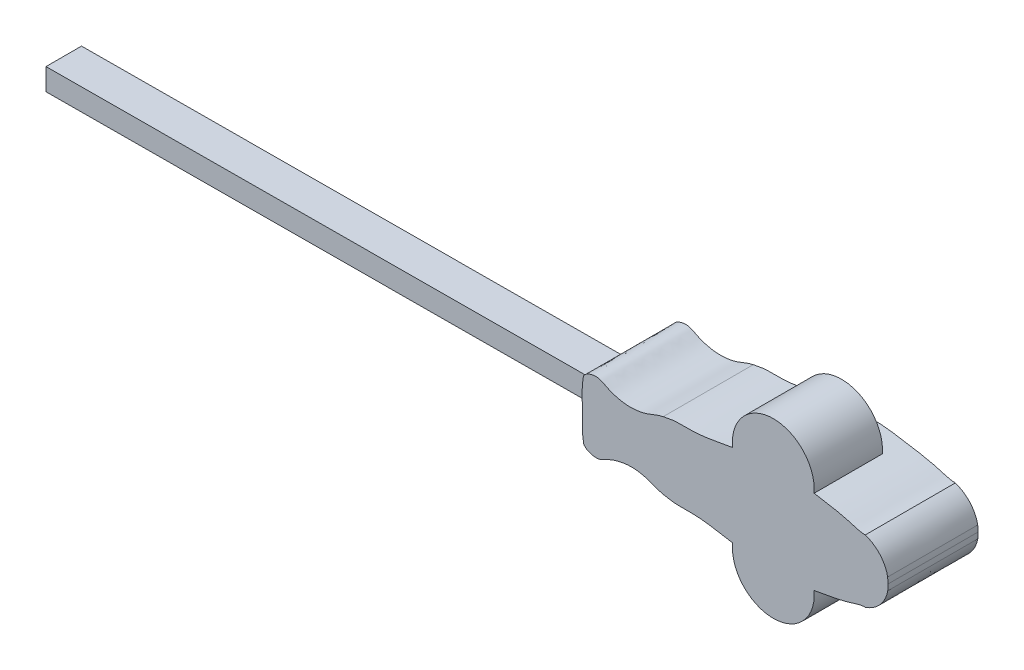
ISO-10303-21;
HEADER;
FILE_DESCRIPTION(('STEP AP214'),'2;1');
FILE_NAME('part.step','',(''),(''),'','','');
FILE_SCHEMA(('AUTOMOTIVE_DESIGN { 1 0 10303 214 1 1 1 1 }'));
ENDSEC;
DATA;
#1=APPLICATION_CONTEXT('core data for automotive mechanical design processes');
#2=APPLICATION_PROTOCOL_DEFINITION('international standard','automotive_design',2000,#1);
#3=PRODUCT_CONTEXT('',#1,'mechanical');
#4=PRODUCT('Part','Part','',(#3));
#5=PRODUCT_RELATED_PRODUCT_CATEGORY('part','',(#4));
#6=PRODUCT_DEFINITION_FORMATION('','',#4);
#7=PRODUCT_DEFINITION_CONTEXT('part definition',#1,'design');
#8=PRODUCT_DEFINITION('design','',#6,#7);
#9=PRODUCT_DEFINITION_SHAPE('','',#8);
#10=(LENGTH_UNIT() NAMED_UNIT(*) SI_UNIT(.MILLI.,.METRE.));
#11=(NAMED_UNIT(*) PLANE_ANGLE_UNIT() SI_UNIT($,.RADIAN.));
#12=(NAMED_UNIT(*) SI_UNIT($,.STERADIAN.) SOLID_ANGLE_UNIT());
#13=UNCERTAINTY_MEASURE_WITH_UNIT(LENGTH_MEASURE(1.E-05),#10,'distance_accuracy_value','');
#14=(GEOMETRIC_REPRESENTATION_CONTEXT(3) GLOBAL_UNCERTAINTY_ASSIGNED_CONTEXT((#13)) GLOBAL_UNIT_ASSIGNED_CONTEXT((#10,
#11,#12)) REPRESENTATION_CONTEXT('',''));
#15=CARTESIAN_POINT('',(0.,0.,0.));
#16=DIRECTION('',(0.,0.,1.));
#17=DIRECTION('',(1.,0.,0.));
#18=AXIS2_PLACEMENT_3D('',#15,#16,#17);
#19=CARTESIAN_POINT('',(0.,0.,-16.5));
#20=DIRECTION('',(-1.,0.,0.));
#21=DIRECTION('',(0.,0.,1.));
#22=AXIS2_PLACEMENT_3D('',#19,#20,#21);
#23=PLANE('',#22);
#24=DIRECTION('',(0.,-1.,0.));
#25=VECTOR('',#24,1.);
#26=CARTESIAN_POINT('',(0.,0.,-4.));
#27=LINE('',#26,#25);
#28=CARTESIAN_POINT('',(0.,0.,-4.));
#29=VERTEX_POINT('',#28);
#30=CARTESIAN_POINT('',(0.,-3.40142625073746,-4.));
#31=VERTEX_POINT('',#30);
#32=EDGE_CURVE('E674',#29,#31,#27,.T.);
#33=ORIENTED_EDGE('',*,*,#32,.F.);
#34=DIRECTION('',(0.,0.,1.));
#35=VECTOR('',#34,1.);
#36=CARTESIAN_POINT('',(0.,0.,-16.5));
#37=LINE('',#36,#35);
#38=CARTESIAN_POINT('',(0.,0.,-16.5));
#39=VERTEX_POINT('',#38);
#40=EDGE_CURVE('E295',#39,#29,#37,.T.);
#41=ORIENTED_EDGE('',*,*,#40,.F.);
#42=DIRECTION('',(0.,-1.,0.));
#43=VECTOR('',#42,1.);
#44=CARTESIAN_POINT('',(0.,0.,-16.5));
#45=LINE('',#44,#43);
#46=CARTESIAN_POINT('',(0.,-3.40142625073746,-16.5));
#47=VERTEX_POINT('',#46);
#48=EDGE_CURVE('E611',#39,#47,#45,.T.);
#49=ORIENTED_EDGE('',*,*,#48,.T.);
#50=DIRECTION('',(0.,0.,1.));
#51=VECTOR('',#50,1.);
#52=CARTESIAN_POINT('',(0.,-3.40142625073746,-16.5));
#53=LINE('',#52,#51);
#54=EDGE_CURVE('E294',#47,#31,#53,.T.);
#55=ORIENTED_EDGE('',*,*,#54,.T.);
#56=EDGE_LOOP('',(#33,#41,#49,#55));
#57=FACE_BOUND('',#56,.T.);
#58=ADVANCED_FACE('F41',(#57),#23,.T.);
#59=CARTESIAN_POINT('',(0.,0.,-16.5));
#60=DIRECTION('',(0.999953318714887,0.00966231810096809,0.));
#61=DIRECTION('',(-0.00966231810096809,0.999953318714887,0.));
#62=AXIS2_PLACEMENT_3D('',#59,#60,#61);
#63=PLANE('',#62);
#64=ORIENTED_EDGE('',*,*,#40,.T.);
#65=DIRECTION('',(-0.00966231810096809,0.999953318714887,0.));
#66=VECTOR('',#65,1.);
#67=CARTESIAN_POINT('',(0.,0.,-4.));
#68=LINE('',#67,#66);
#69=CARTESIAN_POINT('',(-0.0328656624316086,3.40126746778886,-4.));
#70=VERTEX_POINT('',#69);
#71=EDGE_CURVE('E314',#29,#70,#68,.T.);
#72=ORIENTED_EDGE('',*,*,#71,.T.);
#73=DIRECTION('',(0.,0.,1.));
#74=VECTOR('',#73,1.);
#75=CARTESIAN_POINT('',(-0.0328656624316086,3.40126746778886,-16.5));
#76=LINE('',#75,#74);
#77=CARTESIAN_POINT('',(-0.0328656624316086,3.40126746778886,-16.5));
#78=VERTEX_POINT('',#77);
#79=EDGE_CURVE('E306',#78,#70,#76,.T.);
#80=ORIENTED_EDGE('',*,*,#79,.F.);
#81=DIRECTION('',(-0.00966231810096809,0.999953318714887,0.));
#82=VECTOR('',#81,1.);
#83=CARTESIAN_POINT('',(0.,0.,-16.5));
#84=LINE('',#83,#82);
#85=EDGE_CURVE('E614',#39,#78,#84,.T.);
#86=ORIENTED_EDGE('',*,*,#85,.F.);
#87=EDGE_LOOP('',(#64,#72,#80,#86));
#88=FACE_BOUND('',#87,.T.);
#89=ADVANCED_FACE('F251',(#88),#63,.F.);
#90=CARTESIAN_POINT('',(-0.0328656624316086,3.40126746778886,-16.5));
#91=CARTESIAN_POINT('',(-0.224843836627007,7.16255319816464,-16.5));
#92=CARTESIAN_POINT('',(0.440236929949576,10.8822575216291,-16.5));
#93=B_SPLINE_CURVE_WITH_KNOTS('',2,(#90,#91,#92),.UNSPECIFIED.,.F.,.F.,(3,3),(0.,1.),.UNSPECIFIED.);
#94=DIRECTION('',(0.,0.,1.));
#95=VECTOR('',#94,1.);
#96=SURFACE_OF_LINEAR_EXTRUSION('',#93,#95);
#97=ORIENTED_EDGE('',*,*,#79,.T.);
#98=CARTESIAN_POINT('',(-0.0328656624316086,3.40126746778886,-4.));
#99=CARTESIAN_POINT('',(-0.224843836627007,7.16255319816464,-4.));
#100=CARTESIAN_POINT('',(0.440236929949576,10.8822575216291,-4.));
#101=B_SPLINE_CURVE_WITH_KNOTS('',2,(#98,#99,#100),.UNSPECIFIED.,.F.,.F.,(3,3),(0.,1.),.UNSPECIFIED.);
#102=CARTESIAN_POINT('',(-0.0579969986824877,3.99976648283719,-4.));
#103=VERTEX_POINT('',#102);
#104=EDGE_CURVE('E643',#70,#103,#101,.T.);
#105=ORIENTED_EDGE('',*,*,#104,.T.);
#106=DIRECTION('',(0.,0.,1.));
#107=VECTOR('',#106,1.);
#108=CARTESIAN_POINT('',(-0.0579969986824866,3.99976648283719,-16.5));
#109=LINE('',#108,#107);
#110=CARTESIAN_POINT('',(-0.0579969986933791,3.99976648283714,9.01614070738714));
#111=VERTEX_POINT('',#110);
#112=EDGE_CURVE('E11',#103,#111,#109,.T.);
#113=ORIENTED_EDGE('',*,*,#112,.T.);
#114=CARTESIAN_POINT('',(-0.0328656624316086,3.40126746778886,9.01614070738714));
#115=CARTESIAN_POINT('',(-0.224843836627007,7.16255319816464,9.01614070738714));
#116=CARTESIAN_POINT('',(0.440236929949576,10.8822575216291,9.01614070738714));
#117=B_SPLINE_CURVE_WITH_KNOTS('',2,(#114,#115,#116),.UNSPECIFIED.,.F.,.F.,(3,3),(0.,1.),.UNSPECIFIED.);
#118=CARTESIAN_POINT('',(-0.0328656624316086,3.40126746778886,9.01614070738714));
#119=VERTEX_POINT('',#118);
#120=EDGE_CURVE('E680',#111,#119,#117,.F.);
#121=ORIENTED_EDGE('',*,*,#120,.T.);
#122=CARTESIAN_POINT('',(-0.0328656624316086,3.40126746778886,16.5));
#123=VERTEX_POINT('',#122);
#124=EDGE_CURVE('E310',#119,#123,#76,.T.);
#125=ORIENTED_EDGE('',*,*,#124,.T.);
#126=CARTESIAN_POINT('',(-0.0328656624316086,3.40126746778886,16.5));
#127=CARTESIAN_POINT('',(-0.224843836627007,7.16255319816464,16.5));
#128=CARTESIAN_POINT('',(0.440236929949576,10.8822575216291,16.5));
#129=B_SPLINE_CURVE_WITH_KNOTS('',2,(#126,#127,#128),.UNSPECIFIED.,.F.,.F.,(3,3),(0.,1.),.UNSPECIFIED.);
#130=CARTESIAN_POINT('',(0.440236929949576,10.8822575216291,16.5));
#131=VERTEX_POINT('',#130);
#132=EDGE_CURVE('E638',#123,#131,#129,.T.);
#133=ORIENTED_EDGE('',*,*,#132,.T.);
#134=DIRECTION('',(0.,0.,1.));
#135=VECTOR('',#134,1.);
#136=CARTESIAN_POINT('',(0.440236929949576,10.8822575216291,-16.5));
#137=LINE('',#136,#135);
#138=CARTESIAN_POINT('',(0.440236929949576,10.8822575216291,-16.5));
#139=VERTEX_POINT('',#138);
#140=EDGE_CURVE('E315',#139,#131,#137,.T.);
#141=ORIENTED_EDGE('',*,*,#140,.F.);
#142=EDGE_CURVE('E624',#78,#139,#93,.T.);
#143=ORIENTED_EDGE('',*,*,#142,.F.);
#144=EDGE_LOOP('',(#97,#105,#113,#121,#125,#133,#141,#143));
#145=FACE_BOUND('',#144,.T.);
#146=ADVANCED_FACE('F43',(#145),#96,.F.);
#147=CARTESIAN_POINT('',(0.440236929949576,10.8822575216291,-16.5));
#148=CARTESIAN_POINT('',(1.2545844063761,11.9870686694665,-16.5));
#149=CARTESIAN_POINT('',(3.1984745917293,12.8617459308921,-16.5));
#150=CARTESIAN_POINT('',(6.06946087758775,12.9836702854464,-16.5));
#151=CARTESIAN_POINT('',(8.10206341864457,11.9647141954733,-16.5));
#152=CARTESIAN_POINT('',(10.410042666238,10.7755542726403,-16.5));
#153=CARTESIAN_POINT('',(13.1861198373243,9.93656936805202,-16.5));
#154=CARTESIAN_POINT('',(16.5420551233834,9.38374930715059,-16.5));
#155=CARTESIAN_POINT('',(20.1718624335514,9.5213119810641,-16.5));
#156=CARTESIAN_POINT('',(24.0575079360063,10.3963118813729,-16.5));
#157=CARTESIAN_POINT('',(27.0776430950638,11.8209129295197,-16.5));
#158=CARTESIAN_POINT('',(29.0453889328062,12.3411585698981,-16.5));
#159=CARTESIAN_POINT('',(29.6585793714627,12.4932887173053,-16.5));
#160=B_SPLINE_CURVE_WITH_KNOTS('',3,(#147,#148,#149,#150,#151,#152,#153,#154,#155,#156,#157,
#158,#159),.UNSPECIFIED.,.F.,.F.,(4,1,1,1,1,1,1,1,1,1,4),(0.,0.120356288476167,
0.182103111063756,0.252493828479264,0.320379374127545,0.416926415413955,0.511670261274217,
0.625759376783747,0.741661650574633,0.867963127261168,0.924773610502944),.UNSPECIFIED.);
#161=DIRECTION('',(0.,0.,1.));
#162=VECTOR('',#161,1.);
#163=SURFACE_OF_LINEAR_EXTRUSION('',#160,#162);
#164=ORIENTED_EDGE('',*,*,#140,.T.);
#165=CARTESIAN_POINT('',(0.440236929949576,10.8822575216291,16.5));
#166=CARTESIAN_POINT('',(1.2545844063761,11.9870686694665,16.5));
#167=CARTESIAN_POINT('',(3.1984745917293,12.8617459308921,16.5));
#168=CARTESIAN_POINT('',(6.06946087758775,12.9836702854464,16.5));
#169=CARTESIAN_POINT('',(8.10206341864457,11.9647141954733,16.5));
#170=CARTESIAN_POINT('',(10.410042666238,10.7755542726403,16.5));
#171=CARTESIAN_POINT('',(13.1861198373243,9.93656936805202,16.5));
#172=CARTESIAN_POINT('',(16.5420551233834,9.38374930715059,16.5));
#173=CARTESIAN_POINT('',(20.1718624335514,9.5213119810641,16.5));
#174=CARTESIAN_POINT('',(24.0575079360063,10.3963118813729,16.5));
#175=CARTESIAN_POINT('',(27.0776430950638,11.8209129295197,16.5));
#176=CARTESIAN_POINT('',(29.0453889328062,12.3411585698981,16.5));
#177=CARTESIAN_POINT('',(29.6585793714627,12.4932887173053,16.5));
#178=B_SPLINE_CURVE_WITH_KNOTS('',3,(#165,#166,#167,#168,#169,#170,#171,#172,#173,#174,#175,
#176,#177),.UNSPECIFIED.,.F.,.F.,(4,1,1,1,1,1,1,1,1,1,4),(0.,0.120356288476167,
0.182103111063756,0.252493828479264,0.320379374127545,0.416926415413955,0.511670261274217,
0.625759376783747,0.741661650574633,0.867963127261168,0.924773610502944),.UNSPECIFIED.);
#179=CARTESIAN_POINT('',(29.6585793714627,12.4932887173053,16.5));
#180=VERTEX_POINT('',#179);
#181=EDGE_CURVE('E378',#131,#180,#178,.T.);
#182=ORIENTED_EDGE('',*,*,#181,.T.);
#183=DIRECTION('',(0.,0.,1.));
#184=VECTOR('',#183,1.);
#185=CARTESIAN_POINT('',(29.6585793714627,12.4932887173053,-16.5));
#186=LINE('',#185,#184);
#187=CARTESIAN_POINT('',(29.6585793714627,12.4932887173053,-16.5));
#188=VERTEX_POINT('',#187);
#189=EDGE_CURVE('E454',#188,#180,#186,.T.);
#190=ORIENTED_EDGE('',*,*,#189,.F.);
#191=EDGE_CURVE('E438',#139,#188,#160,.T.);
#192=ORIENTED_EDGE('',*,*,#191,.F.);
#193=EDGE_LOOP('',(#164,#182,#190,#192));
#194=FACE_BOUND('',#193,.T.);
#195=ADVANCED_FACE('F430',(#194),#163,.F.);
#196=CARTESIAN_POINT('',(29.6585793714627,12.4932887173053,-16.5));
#197=CARTESIAN_POINT('',(31.0128652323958,12.7506046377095,-16.5));
#198=CARTESIAN_POINT('',(33.0414585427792,13.2110228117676,-16.5));
#199=CARTESIAN_POINT('',(36.2612563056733,13.2560790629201,-16.5));
#200=CARTESIAN_POINT('',(39.0452583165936,13.2577644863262,-16.5));
#201=CARTESIAN_POINT('',(42.4985052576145,13.3903631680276,-16.5));
#202=CARTESIAN_POINT('',(46.0869267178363,13.7929133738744,-16.5));
#203=CARTESIAN_POINT('',(49.779062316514,14.4884361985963,-16.5));
#204=CARTESIAN_POINT('',(53.4778441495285,15.157919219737,-16.5));
#205=CARTESIAN_POINT('',(57.1168962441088,15.7270449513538,-16.5));
#206=CARTESIAN_POINT('',(60.9657898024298,16.2710657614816,-16.5));
#207=CARTESIAN_POINT('',(64.9828941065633,16.6262630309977,-16.5));
#208=CARTESIAN_POINT('',(69.1101359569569,17.0899493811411,-16.5));
#209=CARTESIAN_POINT('',(73.4451248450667,17.0625696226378,-16.5));
#210=CARTESIAN_POINT('',(77.6235824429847,16.9670082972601,-16.5));
#211=CARTESIAN_POINT('',(81.8363104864,16.3230746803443,-16.5));
#212=CARTESIAN_POINT('',(86.1669893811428,15.6372598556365,-16.5));
#213=CARTESIAN_POINT('',(91.7093018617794,14.7383170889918,-16.5));
#214=CARTESIAN_POINT('',(97.6251708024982,13.4829344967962,-16.5));
#215=CARTESIAN_POINT('',(101.818778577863,11.9447202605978,-16.5));
#216=CARTESIAN_POINT('',(103.707407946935,11.9908059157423,-16.5));
#217=B_SPLINE_CURVE_WITH_KNOTS('',3,(#196,#197,#198,#199,#200,#201,#202,#203,#204,#205,#206,
#207,#208,#209,#210,#211,#212,#213,#214,#215,#216),.UNSPECIFIED.,.F.,.F.,(4,1,1,1,1,1,1,1,1,1,1,
1,1,1,1,1,1,1,4),(0.,0.0553981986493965,0.0826774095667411,0.128818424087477,0.167035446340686,
0.221096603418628,0.273333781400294,0.317568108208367,0.371733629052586,0.420941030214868,
0.473294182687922,0.533363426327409,0.587167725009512,0.646878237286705,0.700631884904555,
0.757710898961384,0.822668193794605,0.92558882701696,1.),.UNSPECIFIED.);
#218=DIRECTION('',(0.,0.,1.));
#219=VECTOR('',#218,1.);
#220=SURFACE_OF_LINEAR_EXTRUSION('',#217,#219);
#221=CARTESIAN_POINT('',(29.6585793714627,12.4932887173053,16.5));
#222=CARTESIAN_POINT('',(31.0128652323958,12.7506046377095,16.5));
#223=CARTESIAN_POINT('',(33.0414585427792,13.2110228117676,16.5));
#224=CARTESIAN_POINT('',(36.2612563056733,13.2560790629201,16.5));
#225=CARTESIAN_POINT('',(39.0452583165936,13.2577644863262,16.5));
#226=CARTESIAN_POINT('',(42.4985052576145,13.3903631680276,16.5));
#227=CARTESIAN_POINT('',(46.0869267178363,13.7929133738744,16.5));
#228=CARTESIAN_POINT('',(49.779062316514,14.4884361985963,16.5));
#229=CARTESIAN_POINT('',(53.4778441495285,15.157919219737,16.5));
#230=CARTESIAN_POINT('',(57.1168962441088,15.7270449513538,16.5));
#231=CARTESIAN_POINT('',(60.9657898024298,16.2710657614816,16.5));
#232=CARTESIAN_POINT('',(64.9828941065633,16.6262630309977,16.5));
#233=CARTESIAN_POINT('',(69.1101359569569,17.0899493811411,16.5));
#234=CARTESIAN_POINT('',(73.4451248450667,17.0625696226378,16.5));
#235=CARTESIAN_POINT('',(77.6235824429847,16.9670082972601,16.5));
#236=CARTESIAN_POINT('',(81.8363104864,16.3230746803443,16.5));
#237=CARTESIAN_POINT('',(86.1669893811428,15.6372598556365,16.5));
#238=CARTESIAN_POINT('',(91.7093018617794,14.7383170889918,16.5));
#239=CARTESIAN_POINT('',(97.6251708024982,13.4829344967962,16.5));
#240=CARTESIAN_POINT('',(101.818778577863,11.9447202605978,16.5));
#241=CARTESIAN_POINT('',(103.707407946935,11.9908059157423,16.5));
#242=B_SPLINE_CURVE_WITH_KNOTS('',3,(#221,#222,#223,#224,#225,#226,#227,#228,#229,#230,#231,
#232,#233,#234,#235,#236,#237,#238,#239,#240,#241),.UNSPECIFIED.,.F.,.F.,(4,1,1,1,1,1,1,1,1,1,1,
1,1,1,1,1,1,1,4),(0.,0.0553981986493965,0.0826774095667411,0.128818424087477,0.167035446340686,
0.221096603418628,0.273333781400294,0.317568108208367,0.371733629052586,0.420941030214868,
0.473294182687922,0.533363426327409,0.587167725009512,0.646878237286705,0.700631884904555,
0.757710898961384,0.822668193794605,0.92558882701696,1.),.UNSPECIFIED.);
#243=CARTESIAN_POINT('',(55.0895967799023,15.4061525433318,16.5));
#244=VERTEX_POINT('',#243);
#245=EDGE_CURVE('E214',#180,#244,#242,.T.);
#246=ORIENTED_EDGE('',*,*,#245,.T.);
#247=DIRECTION('',(0.,0.,1.));
#248=VECTOR('',#247,1.);
#249=CARTESIAN_POINT('',(55.0895967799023,15.4061525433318,-8.5));
#250=LINE('',#249,#248);
#251=CARTESIAN_POINT('',(55.0895967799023,15.4061525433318,-8.5));
#252=VERTEX_POINT('',#251);
#253=EDGE_CURVE('E62',#252,#244,#250,.T.);
#254=ORIENTED_EDGE('',*,*,#253,.F.);
#255=CARTESIAN_POINT('',(55.0895967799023,15.4061525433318,-8.5));
#256=CARTESIAN_POINT('',(55.8060649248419,15.5197730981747,-8.5));
#257=CARTESIAN_POINT('',(57.7371095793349,15.8147088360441,-8.5));
#258=CARTESIAN_POINT('',(60.9657898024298,16.2710657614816,-8.5));
#259=CARTESIAN_POINT('',(64.9828941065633,16.6262630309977,-8.5));
#260=CARTESIAN_POINT('',(69.1101359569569,17.0899493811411,-8.5));
#261=CARTESIAN_POINT('',(73.4451248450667,17.0625696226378,-8.5));
#262=CARTESIAN_POINT('',(77.6235824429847,16.9670082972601,-8.5));
#263=CARTESIAN_POINT('',(81.4946798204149,16.3752943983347,-8.5));
#264=CARTESIAN_POINT('',(83.8851899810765,15.9983753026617,-8.5));
#265=CARTESIAN_POINT('',(84.9507542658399,15.8287112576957,-8.5));
#266=B_SPLINE_CURVE_WITH_KNOTS('',3,(#255,#256,#257,#258,#259,#260,#261,#262,#263,#264,#265),
.UNSPECIFIED.,.F.,.F.,(4,1,1,1,1,1,1,1,4),(0.342661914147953,0.371733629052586,
0.420941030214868,0.473294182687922,0.533363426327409,0.587167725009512,0.646878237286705,
0.700631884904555,0.743880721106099),.UNSPECIFIED.);
#267=CARTESIAN_POINT('',(84.9507542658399,15.8287112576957,-8.5));
#268=VERTEX_POINT('',#267);
#269=EDGE_CURVE('E66',#252,#268,#266,.T.);
#270=ORIENTED_EDGE('',*,*,#269,.T.);
#271=DIRECTION('',(0.,0.,1.));
#272=VECTOR('',#271,1.);
#273=CARTESIAN_POINT('',(84.9507542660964,15.828711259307,-8.5));
#274=LINE('',#273,#272);
#275=CARTESIAN_POINT('',(84.9507542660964,15.828711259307,16.5));
#276=VERTEX_POINT('',#275);
#277=EDGE_CURVE('E216',#268,#276,#274,.T.);
#278=ORIENTED_EDGE('',*,*,#277,.T.);
#279=CARTESIAN_POINT('',(103.707407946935,11.9908059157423,16.5));
#280=VERTEX_POINT('',#279);
#281=EDGE_CURVE('E202',#276,#280,#242,.T.);
#282=ORIENTED_EDGE('',*,*,#281,.T.);
#283=DIRECTION('',(0.,0.,1.));
#284=VECTOR('',#283,1.);
#285=CARTESIAN_POINT('',(103.707407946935,11.9908059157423,-16.5));
#286=LINE('',#285,#284);
#287=CARTESIAN_POINT('',(103.707407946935,11.9908059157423,-16.5));
#288=VERTEX_POINT('',#287);
#289=EDGE_CURVE('E457',#288,#280,#286,.T.);
#290=ORIENTED_EDGE('',*,*,#289,.F.);
#291=EDGE_CURVE('E444',#188,#288,#217,.T.);
#292=ORIENTED_EDGE('',*,*,#291,.F.);
#293=ORIENTED_EDGE('',*,*,#189,.T.);
#294=EDGE_LOOP('',(#246,#254,#270,#278,#282,#290,#292,#293));
#295=FACE_BOUND('',#294,.T.);
#296=ADVANCED_FACE('F217',(#295),#220,.F.);
#297=CARTESIAN_POINT('',(103.707407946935,11.9908059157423,-16.5));
#298=CARTESIAN_POINT('',(105.28126794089,11.4133673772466,-16.5));
#299=CARTESIAN_POINT('',(109.12557010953,9.28181191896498,-16.5));
#300=CARTESIAN_POINT('',(111.416904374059,5.30759409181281,-16.5));
#301=CARTESIAN_POINT('',(111.90109030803,2.73355710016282,-16.5));
#302=B_SPLINE_CURVE_WITH_KNOTS('',3,(#297,#298,#299,#300,#301),.UNSPECIFIED.,.F.,.F.,(4,1,4),
(0.,0.39082533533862,1.),.UNSPECIFIED.);
#303=DIRECTION('',(0.,0.,1.));
#304=VECTOR('',#303,1.);
#305=SURFACE_OF_LINEAR_EXTRUSION('',#302,#304);
#306=ORIENTED_EDGE('',*,*,#289,.T.);
#307=CARTESIAN_POINT('',(103.707407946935,11.9908059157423,16.5));
#308=CARTESIAN_POINT('',(105.28126794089,11.4133673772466,16.5));
#309=CARTESIAN_POINT('',(109.12557010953,9.28181191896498,16.5));
#310=CARTESIAN_POINT('',(111.416904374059,5.30759409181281,16.5));
#311=CARTESIAN_POINT('',(111.90109030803,2.73355710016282,16.5));
#312=B_SPLINE_CURVE_WITH_KNOTS('',3,(#307,#308,#309,#310,#311),.UNSPECIFIED.,.F.,.F.,(4,1,4),
(0.,0.39082533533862,1.),.UNSPECIFIED.);
#313=CARTESIAN_POINT('',(111.90109030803,2.73355710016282,16.5));
#314=VERTEX_POINT('',#313);
#315=EDGE_CURVE('E210',#280,#314,#312,.T.);
#316=ORIENTED_EDGE('',*,*,#315,.T.);
#317=DIRECTION('',(0.,0.,1.));
#318=VECTOR('',#317,1.);
#319=CARTESIAN_POINT('',(111.90109030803,2.73355710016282,-16.5));
#320=LINE('',#319,#318);
#321=CARTESIAN_POINT('',(111.90109030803,2.73355710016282,-16.5));
#322=VERTEX_POINT('',#321);
#323=EDGE_CURVE('E460',#322,#314,#320,.T.);
#324=ORIENTED_EDGE('',*,*,#323,.F.);
#325=EDGE_CURVE('E518',#288,#322,#302,.T.);
#326=ORIENTED_EDGE('',*,*,#325,.F.);
#327=EDGE_LOOP('',(#306,#316,#324,#326));
#328=FACE_BOUND('',#327,.T.);
#329=ADVANCED_FACE('F515',(#328),#305,.F.);
#330=CARTESIAN_POINT('',(112.,0.541102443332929,-16.5));
#331=CARTESIAN_POINT('',(111.994702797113,1.63754310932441,-16.5));
#332=CARTESIAN_POINT('',(111.90109030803,2.73355710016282,-16.5));
#333=B_SPLINE_CURVE_WITH_KNOTS('',2,(#330,#331,#332),.UNSPECIFIED.,.F.,.F.,(3,3),(0.5,1.),.UNSPECIFIED.);
#334=DIRECTION('',(0.,0.,1.));
#335=VECTOR('',#334,1.);
#336=SURFACE_OF_LINEAR_EXTRUSION('',#333,#335);
#337=ORIENTED_EDGE('',*,*,#323,.T.);
#338=CARTESIAN_POINT('',(112.,0.541102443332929,16.5));
#339=CARTESIAN_POINT('',(111.994702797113,1.63754310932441,16.5));
#340=CARTESIAN_POINT('',(111.90109030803,2.73355710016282,16.5));
#341=B_SPLINE_CURVE_WITH_KNOTS('',2,(#338,#339,#340),.UNSPECIFIED.,.F.,.F.,(3,3),(0.5,1.),.UNSPECIFIED.);
#342=CARTESIAN_POINT('',(112.,0.54110244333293,16.5));
#343=VERTEX_POINT('',#342);
#344=EDGE_CURVE('E356',#343,#314,#341,.T.);
#345=ORIENTED_EDGE('',*,*,#344,.F.);
#346=DIRECTION('',(0.,0.,1.));
#347=VECTOR('',#346,1.);
#348=CARTESIAN_POINT('',(112.,0.54110244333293,-16.5));
#349=LINE('',#348,#347);
#350=CARTESIAN_POINT('',(112.,0.54110244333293,-16.5));
#351=VERTEX_POINT('',#350);
#352=EDGE_CURVE('E463',#351,#343,#349,.T.);
#353=ORIENTED_EDGE('',*,*,#352,.F.);
#354=EDGE_CURVE('E523',#351,#322,#333,.T.);
#355=ORIENTED_EDGE('',*,*,#354,.T.);
#356=EDGE_LOOP('',(#337,#345,#353,#355));
#357=FACE_BOUND('',#356,.T.);
#358=ADVANCED_FACE('F538',(#357),#336,.T.);
#359=CARTESIAN_POINT('',(112.,0.541102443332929,-16.5));
#360=CARTESIAN_POINT('',(112.005297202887,-0.555338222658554,-16.5));
#361=CARTESIAN_POINT('',(111.922279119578,-1.65220556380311,-16.5));
#362=B_SPLINE_CURVE_WITH_KNOTS('',2,(#359,#360,#361),.UNSPECIFIED.,.F.,.F.,(3,3),(0.5,1.),.UNSPECIFIED.);
#363=DIRECTION('',(0.,0.,1.));
#364=VECTOR('',#363,1.);
#365=SURFACE_OF_LINEAR_EXTRUSION('',#362,#364);
#366=ORIENTED_EDGE('',*,*,#352,.T.);
#367=CARTESIAN_POINT('',(112.,0.541102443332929,16.5));
#368=CARTESIAN_POINT('',(112.005297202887,-0.555338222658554,16.5));
#369=CARTESIAN_POINT('',(111.922279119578,-1.65220556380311,16.5));
#370=B_SPLINE_CURVE_WITH_KNOTS('',2,(#367,#368,#369),.UNSPECIFIED.,.F.,.F.,(3,3),(0.5,1.),.UNSPECIFIED.);
#371=CARTESIAN_POINT('',(111.922279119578,-1.65220556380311,16.5));
#372=VERTEX_POINT('',#371);
#373=EDGE_CURVE('E347',#343,#372,#370,.T.);
#374=ORIENTED_EDGE('',*,*,#373,.T.);
#375=DIRECTION('',(0.,0.,1.));
#376=VECTOR('',#375,1.);
#377=CARTESIAN_POINT('',(111.922279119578,-1.65220556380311,-16.5));
#378=LINE('',#377,#376);
#379=CARTESIAN_POINT('',(111.922279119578,-1.65220556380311,-16.5));
#380=VERTEX_POINT('',#379);
#381=EDGE_CURVE('E466',#380,#372,#378,.T.);
#382=ORIENTED_EDGE('',*,*,#381,.F.);
#383=EDGE_CURVE('E509',#351,#380,#362,.T.);
#384=ORIENTED_EDGE('',*,*,#383,.F.);
#385=EDGE_LOOP('',(#366,#374,#382,#384));
#386=FACE_BOUND('',#385,.T.);
#387=ADVANCED_FACE('F508',(#386),#365,.F.);
#388=CARTESIAN_POINT('',(103.818425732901,-10.9881922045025,-16.5));
#389=CARTESIAN_POINT('',(105.386632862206,-10.3955734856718,-16.5));
#390=CARTESIAN_POINT('',(109.210159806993,-8.22697266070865,-16.5));
#391=CARTESIAN_POINT('',(111.462986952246,-4.23080075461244,-16.5));
#392=CARTESIAN_POINT('',(111.922279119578,-1.65220556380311,-16.5));
#393=B_SPLINE_CURVE_WITH_KNOTS('',3,(#388,#389,#390,#391,#392),.UNSPECIFIED.,.F.,.F.,(4,1,4),
(0.,0.39082533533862,1.),.UNSPECIFIED.);
#394=DIRECTION('',(0.,0.,1.));
#395=VECTOR('',#394,1.);
#396=SURFACE_OF_LINEAR_EXTRUSION('',#393,#395);
#397=ORIENTED_EDGE('',*,*,#381,.T.);
#398=CARTESIAN_POINT('',(103.818425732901,-10.9881922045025,16.5));
#399=CARTESIAN_POINT('',(105.386632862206,-10.3955734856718,16.5));
#400=CARTESIAN_POINT('',(109.210159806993,-8.22697266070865,16.5));
#401=CARTESIAN_POINT('',(111.462986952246,-4.23080075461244,16.5));
#402=CARTESIAN_POINT('',(111.922279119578,-1.65220556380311,16.5));
#403=B_SPLINE_CURVE_WITH_KNOTS('',3,(#398,#399,#400,#401,#402),.UNSPECIFIED.,.F.,.F.,(4,1,4),
(0.,0.39082533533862,1.),.UNSPECIFIED.);
#404=CARTESIAN_POINT('',(103.818425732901,-10.9881922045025,16.5));
#405=VERTEX_POINT('',#404);
#406=EDGE_CURVE('E326',#405,#372,#403,.T.);
#407=ORIENTED_EDGE('',*,*,#406,.F.);
#408=DIRECTION('',(0.,0.,1.));
#409=VECTOR('',#408,1.);
#410=CARTESIAN_POINT('',(103.818425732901,-10.9881922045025,-16.5));
#411=LINE('',#410,#409);
#412=CARTESIAN_POINT('',(103.818425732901,-10.9881922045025,-16.5));
#413=VERTEX_POINT('',#412);
#414=EDGE_CURVE('E469',#413,#405,#411,.T.);
#415=ORIENTED_EDGE('',*,*,#414,.F.);
#416=EDGE_CURVE('E505',#413,#380,#393,.T.);
#417=ORIENTED_EDGE('',*,*,#416,.T.);
#418=EDGE_LOOP('',(#397,#407,#415,#417));
#419=FACE_BOUND('',#418,.T.);
#420=ADVANCED_FACE('F503',(#419),#396,.T.);
#421=CARTESIAN_POINT('',(29.7779090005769,-12.2061348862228,-16.5));
#422=CARTESIAN_POINT('',(31.134617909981,-12.4503532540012,-16.5));
#423=CARTESIAN_POINT('',(33.1675652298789,-12.8911490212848,-16.5));
#424=CARTESIAN_POINT('',(36.3876480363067,-12.9050924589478,-16.5));
#425=CARTESIAN_POINT('',(39.1715363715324,-12.8798778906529,-16.5));
#426=CARTESIAN_POINT('',(42.6259033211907,-12.9791040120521,-16.5));
#427=CARTESIAN_POINT('',(46.2180468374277,-13.3469629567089,-16.5));
#428=CARTESIAN_POINT('',(49.9167304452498,-14.0067787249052,-16.5));
#429=CARTESIAN_POINT('',(53.6218083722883,-14.6404916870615,-16.5));
#430=CARTESIAN_POINT('',(57.2661896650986,-15.1744291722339,-16.5));
#431=CARTESIAN_POINT('',(61.1201600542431,-15.6812353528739,-16.5));
#432=CARTESIAN_POINT('',(65.1405088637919,-15.9976015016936,-16.5));
#433=CARTESIAN_POINT('',(69.2720383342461,-16.4213874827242,-16.5));
#434=CARTESIAN_POINT('',(73.6065603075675,-16.3521229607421,-16.5));
#435=CARTESIAN_POINT('',(77.7838995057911,-16.2161925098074,-16.5));
#436=CARTESIAN_POINT('',(81.9902090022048,-15.5315842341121,-16.5));
#437=CARTESIAN_POINT('',(86.3140591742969,-14.8039570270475,-16.5));
#438=CARTESIAN_POINT('',(91.8474270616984,-13.8515046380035,-16.5));
#439=CARTESIAN_POINT('',(97.7508899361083,-12.5390196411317,-16.5));
#440=CARTESIAN_POINT('',(101.929439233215,-10.9603572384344,-16.5));
#441=CARTESIAN_POINT('',(103.818425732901,-10.9881922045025,-16.5));
#442=B_SPLINE_CURVE_WITH_KNOTS('',3,(#421,#422,#423,#424,#425,#426,#427,#428,#429,#430,#431,
#432,#433,#434,#435,#436,#437,#438,#439,#440,#441),.UNSPECIFIED.,.F.,.F.,(4,1,1,1,1,1,1,1,1,1,1,
1,1,1,1,1,1,1,4),(0.,0.0553981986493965,0.0826774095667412,0.128818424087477,0.167035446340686,
0.221096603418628,0.273333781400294,0.317568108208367,0.371733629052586,0.420941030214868,
0.473294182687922,0.533363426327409,0.587167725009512,0.646878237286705,0.700631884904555,
0.757710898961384,0.822668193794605,0.92558882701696,1.),.UNSPECIFIED.);
#443=DIRECTION('',(0.,0.,1.));
#444=VECTOR('',#443,1.);
#445=SURFACE_OF_LINEAR_EXTRUSION('',#442,#444);
#446=DIRECTION('',(0.,0.,1.));
#447=VECTOR('',#446,1.);
#448=CARTESIAN_POINT('',(55.0764935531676,-14.8493703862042,-8.5));
#449=LINE('',#448,#447);
#450=CARTESIAN_POINT('',(55.0764935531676,-14.8493703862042,-8.5));
#451=VERTEX_POINT('',#450);
#452=CARTESIAN_POINT('',(55.0764935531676,-14.8493703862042,16.5));
#453=VERTEX_POINT('',#452);
#454=EDGE_CURVE('E595',#451,#453,#449,.T.);
#455=ORIENTED_EDGE('',*,*,#454,.T.);
#456=CARTESIAN_POINT('',(29.7779090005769,-12.2061348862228,16.5));
#457=CARTESIAN_POINT('',(31.134617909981,-12.4503532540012,16.5));
#458=CARTESIAN_POINT('',(33.1675652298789,-12.8911490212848,16.5));
#459=CARTESIAN_POINT('',(36.3876480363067,-12.9050924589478,16.5));
#460=CARTESIAN_POINT('',(39.1715363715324,-12.8798778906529,16.5));
#461=CARTESIAN_POINT('',(42.6259033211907,-12.9791040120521,16.5));
#462=CARTESIAN_POINT('',(46.2180468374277,-13.3469629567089,16.5));
#463=CARTESIAN_POINT('',(49.9167304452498,-14.0067787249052,16.5));
#464=CARTESIAN_POINT('',(53.6218083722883,-14.6404916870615,16.5));
#465=CARTESIAN_POINT('',(57.2661896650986,-15.1744291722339,16.5));
#466=CARTESIAN_POINT('',(61.1201600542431,-15.6812353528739,16.5));
#467=CARTESIAN_POINT('',(65.1405088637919,-15.9976015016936,16.5));
#468=CARTESIAN_POINT('',(69.2720383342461,-16.4213874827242,16.5));
#469=CARTESIAN_POINT('',(73.6065603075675,-16.3521229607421,16.5));
#470=CARTESIAN_POINT('',(77.7838995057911,-16.2161925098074,16.5));
#471=CARTESIAN_POINT('',(81.9902090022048,-15.5315842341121,16.5));
#472=CARTESIAN_POINT('',(86.3140591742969,-14.8039570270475,16.5));
#473=CARTESIAN_POINT('',(91.8474270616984,-13.8515046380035,16.5));
#474=CARTESIAN_POINT('',(97.7508899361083,-12.5390196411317,16.5));
#475=CARTESIAN_POINT('',(101.929439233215,-10.9603572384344,16.5));
#476=CARTESIAN_POINT('',(103.818425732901,-10.9881922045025,16.5));
#477=B_SPLINE_CURVE_WITH_KNOTS('',3,(#456,#457,#458,#459,#460,#461,#462,#463,#464,#465,#466,
#467,#468,#469,#470,#471,#472,#473,#474,#475,#476),.UNSPECIFIED.,.F.,.F.,(4,1,1,1,1,1,1,1,1,1,1,
1,1,1,1,1,1,1,4),(0.,0.0553981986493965,0.0826774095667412,0.128818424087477,0.167035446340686,
0.221096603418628,0.273333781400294,0.317568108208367,0.371733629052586,0.420941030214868,
0.473294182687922,0.533363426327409,0.587167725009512,0.646878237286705,0.700631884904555,
0.757710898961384,0.822668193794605,0.92558882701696,1.),.UNSPECIFIED.);
#478=CARTESIAN_POINT('',(29.7779090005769,-12.2061348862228,16.5));
#479=VERTEX_POINT('',#478);
#480=EDGE_CURVE('E321',#479,#453,#477,.T.);
#481=ORIENTED_EDGE('',*,*,#480,.F.);
#482=DIRECTION('',(0.,0.,1.));
#483=VECTOR('',#482,1.);
#484=CARTESIAN_POINT('',(29.7779090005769,-12.2061348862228,-16.5));
#485=LINE('',#484,#483);
#486=CARTESIAN_POINT('',(29.7779090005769,-12.2061348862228,-16.5));
#487=VERTEX_POINT('',#486);
#488=EDGE_CURVE('E472',#487,#479,#485,.T.);
#489=ORIENTED_EDGE('',*,*,#488,.F.);
#490=EDGE_CURVE('E499',#487,#413,#442,.T.);
#491=ORIENTED_EDGE('',*,*,#490,.T.);
#492=ORIENTED_EDGE('',*,*,#414,.T.);
#493=CARTESIAN_POINT('',(84.9410694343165,-15.0339759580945,16.5));
#494=VERTEX_POINT('',#493);
#495=EDGE_CURVE('E327',#494,#405,#477,.T.);
#496=ORIENTED_EDGE('',*,*,#495,.F.);
#497=DIRECTION('',(0.,0.,1.));
#498=VECTOR('',#497,1.);
#499=CARTESIAN_POINT('',(84.9410694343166,-15.0339759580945,-8.5));
#500=LINE('',#499,#498);
#501=CARTESIAN_POINT('',(84.9410694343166,-15.0339759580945,-8.5));
#502=VERTEX_POINT('',#501);
#503=EDGE_CURVE('E591',#502,#494,#500,.T.);
#504=ORIENTED_EDGE('',*,*,#503,.F.);
#505=CARTESIAN_POINT('',(84.9410694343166,-15.0339759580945,-8.5));
#506=CARTESIAN_POINT('',(83.9300533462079,-15.2048289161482,-8.5));
#507=CARTESIAN_POINT('',(81.5960721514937,-15.5957329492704,-8.5));
#508=CARTESIAN_POINT('',(77.7838995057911,-16.2161925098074,-8.5));
#509=CARTESIAN_POINT('',(73.6065603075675,-16.3521229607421,-8.5));
#510=CARTESIAN_POINT('',(69.2720383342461,-16.4213874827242,-8.5));
#511=CARTESIAN_POINT('',(65.1405088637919,-15.9976015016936,-8.5));
#512=CARTESIAN_POINT('',(61.1201600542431,-15.6812353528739,-8.5));
#513=CARTESIAN_POINT('',(57.8339431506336,-15.2490900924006,-8.5));
#514=CARTESIAN_POINT('',(55.8470548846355,-14.9646211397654,-8.5));
#515=CARTESIAN_POINT('',(55.0764935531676,-14.8493703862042,-8.5));
#516=B_SPLINE_CURVE_WITH_KNOTS('',3,(#505,#506,#507,#508,#509,#510,#511,#512,#513,#514,#515),
.UNSPECIFIED.,.F.,.F.,(4,1,1,1,1,1,1,1,4),(0.340509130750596,0.38160802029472,0.43536166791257,
0.495072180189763,0.548876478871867,0.608945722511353,0.661298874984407,0.710506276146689,
0.741730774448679),.UNSPECIFIED.);
#517=EDGE_CURVE('E588',#502,#451,#516,.T.);
#518=ORIENTED_EDGE('',*,*,#517,.T.);
#519=EDGE_LOOP('',(#455,#481,#489,#491,#492,#496,#504,#518));
#520=FACE_BOUND('',#519,.T.);
#521=ADVANCED_FACE('F497',(#520),#445,.T.);
#522=CARTESIAN_POINT('',(0.545364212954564,-10.8774958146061,-16.5));
#523=CARTESIAN_POINT('',(1.37034871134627,-11.9743869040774,-16.5));
#524=CARTESIAN_POINT('',(3.32259956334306,-12.8302408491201,-16.5));
#525=CARTESIAN_POINT('',(6.19462989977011,-12.9244191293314,-16.5));
#526=CARTESIAN_POINT('',(8.21729207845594,-11.8858709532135,-16.5));
#527=CARTESIAN_POINT('',(10.5136735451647,-10.6744661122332,-16.5));
#528=CARTESIAN_POINT('',(13.281514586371,-9.80869703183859,-16.5));
#529=CARTESIAN_POINT('',(16.6319516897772,-9.22347666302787,-16.5));
#530=CARTESIAN_POINT('',(20.2629187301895,-9.32596056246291,-16.5));
#531=CARTESIAN_POINT('',(24.1568373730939,-10.1633752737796,-16.5));
#532=CARTESIAN_POINT('',(27.1905964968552,-11.558728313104,-16.5));
#533=CARTESIAN_POINT('',(29.1632772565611,-12.0599366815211,-16.5));
#534=CARTESIAN_POINT('',(29.7779090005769,-12.2061348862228,-16.5));
#535=B_SPLINE_CURVE_WITH_KNOTS('',3,(#522,#523,#524,#525,#526,#527,#528,#529,#530,#531,#532,
#533,#534),.UNSPECIFIED.,.F.,.F.,(4,1,1,1,1,1,1,1,1,1,4),(0.,0.120356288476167,
0.182103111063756,0.252493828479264,0.320379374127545,0.416926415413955,0.511670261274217,
0.625759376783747,0.741661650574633,0.867963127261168,0.924773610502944),.UNSPECIFIED.);
#536=DIRECTION('',(0.,0.,1.));
#537=VECTOR('',#536,1.);
#538=SURFACE_OF_LINEAR_EXTRUSION('',#535,#537);
#539=ORIENTED_EDGE('',*,*,#488,.T.);
#540=CARTESIAN_POINT('',(0.545364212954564,-10.8774958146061,16.5));
#541=CARTESIAN_POINT('',(1.37034871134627,-11.9743869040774,16.5));
#542=CARTESIAN_POINT('',(3.32259956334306,-12.8302408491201,16.5));
#543=CARTESIAN_POINT('',(6.19462989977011,-12.9244191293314,16.5));
#544=CARTESIAN_POINT('',(8.21729207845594,-11.8858709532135,16.5));
#545=CARTESIAN_POINT('',(10.5136735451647,-10.6744661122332,16.5));
#546=CARTESIAN_POINT('',(13.281514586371,-9.80869703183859,16.5));
#547=CARTESIAN_POINT('',(16.6319516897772,-9.22347666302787,16.5));
#548=CARTESIAN_POINT('',(20.2629187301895,-9.32596056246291,16.5));
#549=CARTESIAN_POINT('',(24.1568373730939,-10.1633752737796,16.5));
#550=CARTESIAN_POINT('',(27.1905964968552,-11.558728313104,16.5));
#551=CARTESIAN_POINT('',(29.1632772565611,-12.0599366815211,16.5));
#552=CARTESIAN_POINT('',(29.7779090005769,-12.2061348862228,16.5));
#553=B_SPLINE_CURVE_WITH_KNOTS('',3,(#540,#541,#542,#543,#544,#545,#546,#547,#548,#549,#550,
#551,#552),.UNSPECIFIED.,.F.,.F.,(4,1,1,1,1,1,1,1,1,1,4),(0.,0.120356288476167,
0.182103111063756,0.252493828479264,0.320379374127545,0.416926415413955,0.511670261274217,
0.625759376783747,0.741661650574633,0.867963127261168,0.924773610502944),.UNSPECIFIED.);
#554=CARTESIAN_POINT('',(0.545364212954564,-10.8774958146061,16.5));
#555=VERTEX_POINT('',#554);
#556=EDGE_CURVE('E334',#555,#479,#553,.T.);
#557=ORIENTED_EDGE('',*,*,#556,.F.);
#558=DIRECTION('',(0.,0.,1.));
#559=VECTOR('',#558,1.);
#560=CARTESIAN_POINT('',(0.545364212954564,-10.8774958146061,-16.5));
#561=LINE('',#560,#559);
#562=CARTESIAN_POINT('',(0.545364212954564,-10.8774958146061,-16.5));
#563=VERTEX_POINT('',#562);
#564=EDGE_CURVE('E300',#563,#555,#561,.T.);
#565=ORIENTED_EDGE('',*,*,#564,.F.);
#566=EDGE_CURVE('E565',#563,#487,#535,.T.);
#567=ORIENTED_EDGE('',*,*,#566,.T.);
#568=EDGE_LOOP('',(#539,#557,#565,#567));
#569=FACE_BOUND('',#568,.T.);
#570=ADVANCED_FACE('F271',(#569),#538,.T.);
#571=CARTESIAN_POINT('',(0.,-3.40142625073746,-16.5));
#572=CARTESIAN_POINT('',(-0.15562647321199,-7.16439135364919,-16.5));
#573=CARTESIAN_POINT('',(0.545364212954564,-10.8774958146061,-16.5));
#574=B_SPLINE_CURVE_WITH_KNOTS('',2,(#571,#572,#573),.UNSPECIFIED.,.F.,.F.,(3,3),(0.,1.),.UNSPECIFIED.);
#575=DIRECTION('',(0.,0.,1.));
#576=VECTOR('',#575,1.);
#577=SURFACE_OF_LINEAR_EXTRUSION('',#574,#576);
#578=CARTESIAN_POINT('',(0.,-3.40142625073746,-4.));
#579=CARTESIAN_POINT('',(-0.15562647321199,-7.16439135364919,-4.));
#580=CARTESIAN_POINT('',(0.545364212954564,-10.8774958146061,-4.));
#581=B_SPLINE_CURVE_WITH_KNOTS('',2,(#578,#579,#580),.UNSPECIFIED.,.F.,.F.,(3,3),(0.,1.),.UNSPECIFIED.);
#582=CARTESIAN_POINT('',(-0.0193472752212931,-4.00014015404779,-4.));
#583=VERTEX_POINT('',#582);
#584=EDGE_CURVE('E666',#31,#583,#581,.T.);
#585=ORIENTED_EDGE('',*,*,#584,.F.);
#586=ORIENTED_EDGE('',*,*,#54,.F.);
#587=EDGE_CURVE('E481',#47,#563,#574,.T.);
#588=ORIENTED_EDGE('',*,*,#587,.T.);
#589=ORIENTED_EDGE('',*,*,#564,.T.);
#590=CARTESIAN_POINT('',(0.,-3.40142625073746,16.5));
#591=CARTESIAN_POINT('',(-0.15562647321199,-7.16439135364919,16.5));
#592=CARTESIAN_POINT('',(0.545364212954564,-10.8774958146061,16.5));
#593=B_SPLINE_CURVE_WITH_KNOTS('',2,(#590,#591,#592),.UNSPECIFIED.,.F.,.F.,(3,3),(0.,1.),.UNSPECIFIED.);
#594=CARTESIAN_POINT('',(0.,-3.40142625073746,16.5));
#595=VERTEX_POINT('',#594);
#596=EDGE_CURVE('E292',#595,#555,#593,.T.);
#597=ORIENTED_EDGE('',*,*,#596,.F.);
#598=CARTESIAN_POINT('',(0.,-3.40142625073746,9.01614070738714));
#599=VERTEX_POINT('',#598);
#600=EDGE_CURVE('E278',#599,#595,#53,.T.);
#601=ORIENTED_EDGE('',*,*,#600,.F.);
#602=CARTESIAN_POINT('',(0.,-3.40142625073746,9.01614070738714));
#603=CARTESIAN_POINT('',(-0.15562647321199,-7.16439135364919,9.01614070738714));
#604=CARTESIAN_POINT('',(0.545364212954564,-10.8774958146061,9.01614070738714));
#605=B_SPLINE_CURVE_WITH_KNOTS('',2,(#602,#603,#604),.UNSPECIFIED.,.F.,.F.,(3,3),(0.,1.),.UNSPECIFIED.);
#606=CARTESIAN_POINT('',(-0.0193472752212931,-4.00014015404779,9.01614070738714));
#607=VERTEX_POINT('',#606);
#608=EDGE_CURVE('E284',#607,#599,#605,.F.);
#609=ORIENTED_EDGE('',*,*,#608,.F.);
#610=DIRECTION('',(0.,0.,1.));
#611=VECTOR('',#610,1.);
#612=CARTESIAN_POINT('',(-0.0193472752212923,-4.00014015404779,-16.5));
#613=LINE('',#612,#611);
#614=EDGE_CURVE('E54',#583,#607,#613,.T.);
#615=ORIENTED_EDGE('',*,*,#614,.F.);
#616=EDGE_LOOP('',(#585,#586,#588,#589,#597,#601,#609,#615));
#617=FACE_BOUND('',#616,.T.);
#618=ADVANCED_FACE('F263',(#617),#577,.T.);
#619=DIRECTION('',(0.,1.,0.));
#620=VECTOR('',#619,1.);
#621=CARTESIAN_POINT('',(0.,0.,9.01614070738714));
#622=LINE('',#621,#620);
#623=CARTESIAN_POINT('',(0.,0.,9.01614070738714));
#624=VERTEX_POINT('',#623);
#625=EDGE_CURVE('E275',#599,#624,#622,.T.);
#626=ORIENTED_EDGE('',*,*,#625,.F.);
#627=ORIENTED_EDGE('',*,*,#600,.T.);
#628=DIRECTION('',(0.,-1.,0.));
#629=VECTOR('',#628,1.);
#630=CARTESIAN_POINT('',(0.,0.,16.5));
#631=LINE('',#630,#629);
#632=CARTESIAN_POINT('',(0.,0.,16.5));
#633=VERTEX_POINT('',#632);
#634=EDGE_CURVE('E485',#633,#595,#631,.T.);
#635=ORIENTED_EDGE('',*,*,#634,.F.);
#636=EDGE_CURVE('E280',#624,#633,#37,.T.);
#637=ORIENTED_EDGE('',*,*,#636,.F.);
#638=EDGE_LOOP('',(#626,#627,#635,#637));
#639=FACE_BOUND('',#638,.T.);
#640=ADVANCED_FACE('F254',(#639),#23,.T.);
#641=ORIENTED_EDGE('',*,*,#124,.F.);
#642=DIRECTION('',(0.00966231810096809,-0.999953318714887,0.));
#643=VECTOR('',#642,1.);
#644=CARTESIAN_POINT('',(0.,0.,9.01614070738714));
#645=LINE('',#644,#643);
#646=EDGE_CURVE('E311',#119,#624,#645,.T.);
#647=ORIENTED_EDGE('',*,*,#646,.T.);
#648=ORIENTED_EDGE('',*,*,#636,.T.);
#649=DIRECTION('',(-0.00966231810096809,0.999953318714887,0.));
#650=VECTOR('',#649,1.);
#651=CARTESIAN_POINT('',(0.,0.,16.5));
#652=LINE('',#651,#650);
#653=EDGE_CURVE('E640',#633,#123,#652,.T.);
#654=ORIENTED_EDGE('',*,*,#653,.T.);
#655=EDGE_LOOP('',(#641,#647,#648,#654));
#656=FACE_BOUND('',#655,.T.);
#657=ADVANCED_FACE('F259',(#656),#63,.F.);
#658=CARTESIAN_POINT('',(0.,0.,-16.5));
#659=DIRECTION('',(0.,0.,1.));
#660=DIRECTION('',(1.,0.,0.));
#661=AXIS2_PLACEMENT_3D('',#658,#659,#660);
#662=PLANE('',#661);
#663=ORIENTED_EDGE('',*,*,#142,.T.);
#664=ORIENTED_EDGE('',*,*,#191,.T.);
#665=ORIENTED_EDGE('',*,*,#291,.T.);
#666=ORIENTED_EDGE('',*,*,#325,.T.);
#667=ORIENTED_EDGE('',*,*,#354,.F.);
#668=ORIENTED_EDGE('',*,*,#383,.T.);
#669=ORIENTED_EDGE('',*,*,#416,.F.);
#670=ORIENTED_EDGE('',*,*,#490,.F.);
#671=ORIENTED_EDGE('',*,*,#566,.F.);
#672=ORIENTED_EDGE('',*,*,#587,.F.);
#673=ORIENTED_EDGE('',*,*,#48,.F.);
#674=ORIENTED_EDGE('',*,*,#85,.T.);
#675=EDGE_LOOP('',(#663,#664,#665,#666,#667,#668,#669,#670,#671,#672,#673,#674));
#676=FACE_BOUND('',#675,.T.);
#677=ADVANCED_FACE('F269',(#676),#662,.F.);
#678=CARTESIAN_POINT('',(0.,0.,16.5));
#679=DIRECTION('',(0.,0.,1.));
#680=DIRECTION('',(1.,0.,0.));
#681=AXIS2_PLACEMENT_3D('',#678,#679,#680);
#682=PLANE('',#681);
#683=ORIENTED_EDGE('',*,*,#132,.F.);
#684=ORIENTED_EDGE('',*,*,#653,.F.);
#685=ORIENTED_EDGE('',*,*,#634,.T.);
#686=ORIENTED_EDGE('',*,*,#596,.T.);
#687=ORIENTED_EDGE('',*,*,#556,.T.);
#688=ORIENTED_EDGE('',*,*,#480,.T.);
#689=CARTESIAN_POINT('',(70.,-16.3622997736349,16.5));
#690=DIRECTION('',(0.,0.,1.));
#691=DIRECTION('',(1.,0.,0.));
#692=AXIS2_PLACEMENT_3D('',#689,#690,#691);
#693=CIRCLE('',#692,15.);
#694=EDGE_CURVE('E235',#453,#494,#693,.T.);
#695=ORIENTED_EDGE('',*,*,#694,.T.);
#696=ORIENTED_EDGE('',*,*,#495,.T.);
#697=ORIENTED_EDGE('',*,*,#406,.T.);
#698=ORIENTED_EDGE('',*,*,#373,.F.);
#699=ORIENTED_EDGE('',*,*,#344,.T.);
#700=ORIENTED_EDGE('',*,*,#315,.F.);
#701=ORIENTED_EDGE('',*,*,#281,.F.);
#702=CARTESIAN_POINT('',(70.,17.0431851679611,16.5));
#703=DIRECTION('',(0.,0.,1.));
#704=DIRECTION('',(1.,0.,0.));
#705=AXIS2_PLACEMENT_3D('',#702,#703,#704);
#706=CIRCLE('',#705,15.);
#707=EDGE_CURVE('E207',#276,#244,#706,.T.);
#708=ORIENTED_EDGE('',*,*,#707,.T.);
#709=ORIENTED_EDGE('',*,*,#245,.F.);
#710=ORIENTED_EDGE('',*,*,#181,.F.);
#711=EDGE_LOOP('',(#683,#684,#685,#686,#687,#688,#695,#696,#697,#698,#699,#700,#701,#708,#709,#710));
#712=FACE_BOUND('',#711,.T.);
#713=ADVANCED_FACE('F204',(#712),#682,.T.);
#714=CARTESIAN_POINT('',(4.98061678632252,4.02410939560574,0.));
#715=DIRECTION('',(-0.00483121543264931,0.999988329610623,0.));
#716=DIRECTION('',(-0.999988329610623,-0.00483121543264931,0.));
#717=AXIS2_PLACEMENT_3D('',#714,#715,#716);
#718=PLANE('',#717);
#719=ORIENTED_EDGE('',*,*,#112,.F.);
#720=DIRECTION('',(-0.999988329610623,-0.00483121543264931,0.));
#721=VECTOR('',#720,1.);
#722=CARTESIAN_POINT('',(4.98061678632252,4.02410939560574,-4.));
#723=LINE('',#722,#721);
#724=CARTESIAN_POINT('',(-204.016944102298,3.01438537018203,-4.));
#725=VERTEX_POINT('',#724);
#726=EDGE_CURVE('E285',#103,#725,#723,.T.);
#727=ORIENTED_EDGE('',*,*,#726,.T.);
#728=DIRECTION('',(0.,0.,-1.));
#729=VECTOR('',#728,1.);
#730=CARTESIAN_POINT('',(-204.016944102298,3.01438537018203,0.));
#731=LINE('',#730,#729);
#732=CARTESIAN_POINT('',(-204.016944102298,3.01438537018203,9.01614070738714));
#733=VERTEX_POINT('',#732);
#734=EDGE_CURVE('E700',#733,#725,#731,.T.);
#735=ORIENTED_EDGE('',*,*,#734,.F.);
#736=DIRECTION('',(-0.999988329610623,-0.00483121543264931,0.));
#737=VECTOR('',#736,1.);
#738=CARTESIAN_POINT('',(4.98061678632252,4.02410939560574,9.01614070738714));
#739=LINE('',#738,#737);
#740=EDGE_CURVE('E703',#111,#733,#739,.T.);
#741=ORIENTED_EDGE('',*,*,#740,.F.);
#742=EDGE_LOOP('',(#719,#727,#735,#741));
#743=FACE_BOUND('',#742,.T.);
#744=ADVANCED_FACE('F411',(#743),#718,.T.);
#745=CARTESIAN_POINT('',(4.98061678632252,4.02410939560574,-4.));
#746=DIRECTION('',(0.,0.,-1.));
#747=DIRECTION('',(0.,1.,0.));
#748=AXIS2_PLACEMENT_3D('',#745,#746,#747);
#749=PLANE('',#748);
#750=ORIENTED_EDGE('',*,*,#104,.F.);
#751=ORIENTED_EDGE('',*,*,#71,.F.);
#752=ORIENTED_EDGE('',*,*,#32,.T.);
#753=ORIENTED_EDGE('',*,*,#584,.T.);
#754=DIRECTION('',(-0.999988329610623,-0.00483121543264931,0.));
#755=VECTOR('',#754,1.);
#756=CARTESIAN_POINT('',(5.01926650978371,-3.97579724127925,-4.));
#757=LINE('',#756,#755);
#758=CARTESIAN_POINT('',(-203.978294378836,-4.98552126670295,-4.));
#759=VERTEX_POINT('',#758);
#760=EDGE_CURVE('E696',#583,#759,#757,.T.);
#761=ORIENTED_EDGE('',*,*,#760,.T.);
#762=DIRECTION('',(0.00483121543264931,-0.999988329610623,0.));
#763=VECTOR('',#762,1.);
#764=CARTESIAN_POINT('',(-204.016944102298,3.01438537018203,-4.));
#765=LINE('',#764,#763);
#766=EDGE_CURVE('E594',#725,#759,#765,.T.);
#767=ORIENTED_EDGE('',*,*,#766,.F.);
#768=ORIENTED_EDGE('',*,*,#726,.F.);
#769=EDGE_LOOP('',(#750,#751,#752,#753,#761,#767,#768));
#770=FACE_BOUND('',#769,.T.);
#771=ADVANCED_FACE('F414',(#770),#749,.T.);
#772=CARTESIAN_POINT('',(4.98061678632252,4.02410939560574,9.01614070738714));
#773=DIRECTION('',(0.,0.,1.));
#774=DIRECTION('',(0.,-1.,0.));
#775=AXIS2_PLACEMENT_3D('',#772,#773,#774);
#776=PLANE('',#775);
#777=ORIENTED_EDGE('',*,*,#120,.F.);
#778=ORIENTED_EDGE('',*,*,#740,.T.);
#779=DIRECTION('',(-0.00483121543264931,0.999988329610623,0.));
#780=VECTOR('',#779,1.);
#781=CARTESIAN_POINT('',(-204.016944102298,3.01438537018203,9.01614070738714));
#782=LINE('',#781,#780);
#783=CARTESIAN_POINT('',(-203.978294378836,-4.98552126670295,9.01614070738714));
#784=VERTEX_POINT('',#783);
#785=EDGE_CURVE('E711',#784,#733,#782,.T.);
#786=ORIENTED_EDGE('',*,*,#785,.F.);
#787=DIRECTION('',(-0.999988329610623,-0.00483121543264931,0.));
#788=VECTOR('',#787,1.);
#789=CARTESIAN_POINT('',(5.01926650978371,-3.97579724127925,9.01614070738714));
#790=LINE('',#789,#788);
#791=EDGE_CURVE('E699',#607,#784,#790,.T.);
#792=ORIENTED_EDGE('',*,*,#791,.F.);
#793=ORIENTED_EDGE('',*,*,#608,.T.);
#794=ORIENTED_EDGE('',*,*,#625,.T.);
#795=ORIENTED_EDGE('',*,*,#646,.F.);
#796=EDGE_LOOP('',(#777,#778,#786,#792,#793,#794,#795));
#797=FACE_BOUND('',#796,.T.);
#798=ADVANCED_FACE('F416',(#797),#776,.T.);
#799=CARTESIAN_POINT('',(5.01926650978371,-3.97579724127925,9.01614070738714));
#800=DIRECTION('',(0.00483121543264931,-0.999988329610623,0.));
#801=DIRECTION('',(0.999988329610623,0.00483121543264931,0.));
#802=AXIS2_PLACEMENT_3D('',#799,#800,#801);
#803=PLANE('',#802);
#804=ORIENTED_EDGE('',*,*,#760,.F.);
#805=ORIENTED_EDGE('',*,*,#614,.T.);
#806=ORIENTED_EDGE('',*,*,#791,.T.);
#807=DIRECTION('',(0.,0.,1.));
#808=VECTOR('',#807,1.);
#809=CARTESIAN_POINT('',(-203.978294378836,-4.98552126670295,-4.));
#810=LINE('',#809,#808);
#811=EDGE_CURVE('E715',#759,#784,#810,.T.);
#812=ORIENTED_EDGE('',*,*,#811,.F.);
#813=EDGE_LOOP('',(#804,#805,#806,#812));
#814=FACE_BOUND('',#813,.T.);
#815=ADVANCED_FACE('F409',(#814),#803,.T.);
#816=CARTESIAN_POINT('',(-203.997619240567,-0.98556794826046,0.));
#817=DIRECTION('',(-0.999988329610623,-0.00483121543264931,0.));
#818=DIRECTION('',(0.00483121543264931,-0.999988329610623,0.));
#819=AXIS2_PLACEMENT_3D('',#816,#817,#818);
#820=PLANE('',#819);
#821=ORIENTED_EDGE('',*,*,#766,.T.);
#822=ORIENTED_EDGE('',*,*,#811,.T.);
#823=ORIENTED_EDGE('',*,*,#785,.T.);
#824=ORIENTED_EDGE('',*,*,#734,.T.);
#825=EDGE_LOOP('',(#821,#822,#823,#824));
#826=FACE_BOUND('',#825,.T.);
#827=ADVANCED_FACE('F405',(#826),#820,.T.);
#828=CARTESIAN_POINT('',(70.,-16.3622997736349,-8.5));
#829=DIRECTION('',(0.,0.,1.));
#830=DIRECTION('',(1.,0.,0.));
#831=AXIS2_PLACEMENT_3D('',#828,#829,#830);
#832=CYLINDRICAL_SURFACE('',#831,15.);
#833=ORIENTED_EDGE('',*,*,#694,.F.);
#834=ORIENTED_EDGE('',*,*,#454,.F.);
#835=CARTESIAN_POINT('',(70.,-16.3622997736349,-8.5));
#836=DIRECTION('',(0.,0.,1.));
#837=DIRECTION('',(1.,0.,0.));
#838=AXIS2_PLACEMENT_3D('',#835,#836,#837);
#839=CIRCLE('',#838,15.);
#840=EDGE_CURVE('E600',#451,#502,#839,.T.);
#841=ORIENTED_EDGE('',*,*,#840,.T.);
#842=ORIENTED_EDGE('',*,*,#503,.T.);
#843=EDGE_LOOP('',(#833,#834,#841,#842));
#844=FACE_BOUND('',#843,.T.);
#845=ADVANCED_FACE('F401',(#844),#832,.T.);
#846=CARTESIAN_POINT('',(70.0113852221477,-16.3625832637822,-8.5));
#847=DIRECTION('',(0.,0.,-1.));
#848=DIRECTION('',(-1.,0.,0.));
#849=AXIS2_PLACEMENT_3D('',#846,#847,#848);
#850=PLANE('',#849);
#851=ORIENTED_EDGE('',*,*,#517,.F.);
#852=ORIENTED_EDGE('',*,*,#840,.F.);
#853=EDGE_LOOP('',(#851,#852));
#854=FACE_BOUND('',#853,.T.);
#855=ADVANCED_FACE('F247',(#854),#850,.T.);
#856=CARTESIAN_POINT('',(70.,17.0431851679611,-8.5));
#857=DIRECTION('',(0.,0.,1.));
#858=DIRECTION('',(1.,0.,0.));
#859=AXIS2_PLACEMENT_3D('',#856,#857,#858);
#860=CYLINDRICAL_SURFACE('',#859,15.);
#861=ORIENTED_EDGE('',*,*,#707,.F.);
#862=ORIENTED_EDGE('',*,*,#277,.F.);
#863=CARTESIAN_POINT('',(70.,17.0431851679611,-8.5));
#864=DIRECTION('',(0.,0.,1.));
#865=DIRECTION('',(1.,0.,0.));
#866=AXIS2_PLACEMENT_3D('',#863,#864,#865);
#867=CIRCLE('',#866,15.);
#868=EDGE_CURVE('E222',#268,#252,#867,.T.);
#869=ORIENTED_EDGE('',*,*,#868,.T.);
#870=ORIENTED_EDGE('',*,*,#253,.T.);
#871=EDGE_LOOP('',(#861,#862,#869,#870));
#872=FACE_BOUND('',#871,.T.);
#873=ADVANCED_FACE('F224',(#872),#860,.T.);
#874=CARTESIAN_POINT('',(70.0108902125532,17.0435196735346,-8.5));
#875=DIRECTION('',(0.,0.,1.));
#876=DIRECTION('',(1.,0.,0.));
#877=AXIS2_PLACEMENT_3D('',#874,#875,#876);
#878=PLANE('',#877);
#879=ORIENTED_EDGE('',*,*,#269,.F.);
#880=ORIENTED_EDGE('',*,*,#868,.F.);
#881=EDGE_LOOP('',(#879,#880));
#882=FACE_BOUND('',#881,.T.);
#883=ADVANCED_FACE('F242',(#882),#878,.F.);
#884=CLOSED_SHELL('',(#58,#89,#146,#195,#296,#329,#358,#387,#420,#521,#570,#618,#640,#657,#677,
#713,#744,#771,#798,#815,#827,#845,#855,#873,#883));
#885=MANIFOLD_SOLID_BREP('B2',#884);
#886=ADVANCED_BREP_SHAPE_REPRESENTATION('',(#18,#885),#14);
#887=SHAPE_DEFINITION_REPRESENTATION(#9,#886);
ENDSEC;
END-ISO-10303-21;
